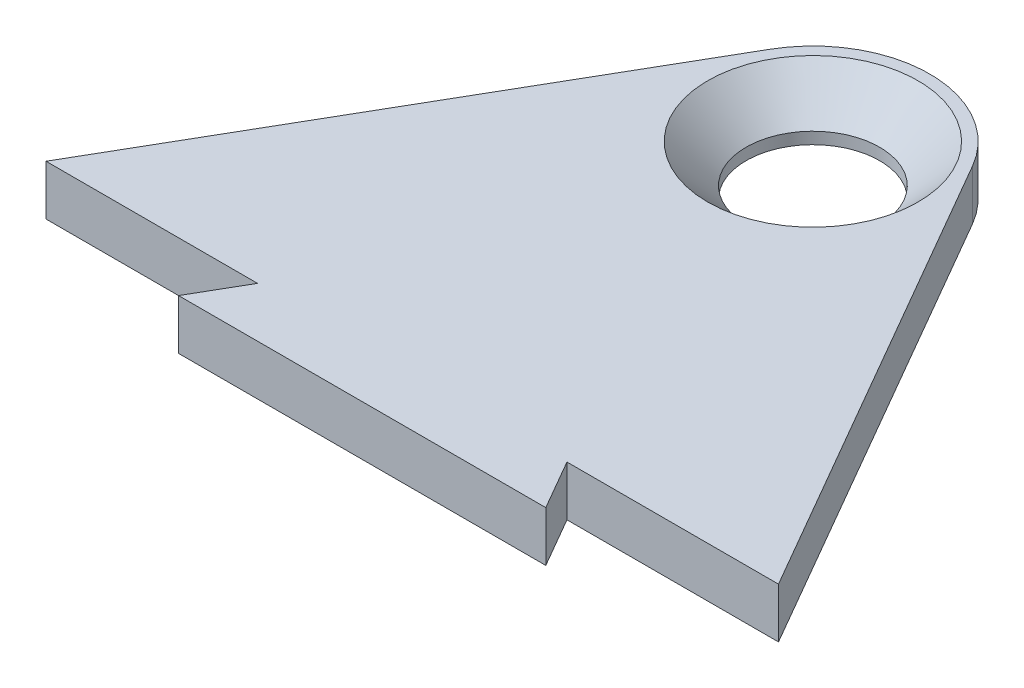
ISO-10303-21;
HEADER;
FILE_DESCRIPTION(('STEP AP214'),'2;1');
FILE_NAME('part.step','',(''),(''),'','','');
FILE_SCHEMA(('AUTOMOTIVE_DESIGN { 1 0 10303 214 1 1 1 1 }'));
ENDSEC;
DATA;
#1=APPLICATION_CONTEXT('core data for automotive mechanical design processes');
#2=APPLICATION_PROTOCOL_DEFINITION('international standard','automotive_design',2000,#1);
#3=PRODUCT_CONTEXT('',#1,'mechanical');
#4=PRODUCT('Part','Part','',(#3));
#5=PRODUCT_RELATED_PRODUCT_CATEGORY('part','',(#4));
#6=PRODUCT_DEFINITION_FORMATION('','',#4);
#7=PRODUCT_DEFINITION_CONTEXT('part definition',#1,'design');
#8=PRODUCT_DEFINITION('design','',#6,#7);
#9=PRODUCT_DEFINITION_SHAPE('','',#8);
#10=(LENGTH_UNIT() NAMED_UNIT(*) SI_UNIT(.MILLI.,.METRE.));
#11=(NAMED_UNIT(*) PLANE_ANGLE_UNIT() SI_UNIT($,.RADIAN.));
#12=(NAMED_UNIT(*) SI_UNIT($,.STERADIAN.) SOLID_ANGLE_UNIT());
#13=UNCERTAINTY_MEASURE_WITH_UNIT(LENGTH_MEASURE(1.E-05),#10,'distance_accuracy_value','');
#14=(GEOMETRIC_REPRESENTATION_CONTEXT(3) GLOBAL_UNCERTAINTY_ASSIGNED_CONTEXT((#13)) GLOBAL_UNIT_ASSIGNED_CONTEXT((#10,
#11,#12)) REPRESENTATION_CONTEXT('',''));
#15=CARTESIAN_POINT('',(0.,0.,0.));
#16=DIRECTION('',(0.,0.,1.));
#17=DIRECTION('',(1.,0.,0.));
#18=AXIS2_PLACEMENT_3D('',#15,#16,#17);
#19=CARTESIAN_POINT('',(0.,3.,-26.9999999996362));
#20=DIRECTION('',(0.,-1.,0.));
#21=DIRECTION('',(0.,0.,-1.));
#22=AXIS2_PLACEMENT_3D('',#19,#20,#21);
#23=CYLINDRICAL_SURFACE('',#22,6.99999999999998);
#24=CARTESIAN_POINT('',(0.,0.,-26.9999999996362));
#25=DIRECTION('',(0.,1.,0.));
#26=DIRECTION('',(0.,0.,1.));
#27=AXIS2_PLACEMENT_3D('',#24,#25,#26);
#28=CIRCLE('',#27,6.99999999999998);
#29=CARTESIAN_POINT('',(6.06217782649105,0.,-30.4999999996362));
#30=VERTEX_POINT('',#29);
#31=CARTESIAN_POINT('',(-6.06217782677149,0.,-30.4999999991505));
#32=VERTEX_POINT('',#31);
#33=EDGE_CURVE('E126',#30,#32,#28,.T.);
#34=ORIENTED_EDGE('',*,*,#33,.T.);
#35=DIRECTION('',(0.,-1.,0.));
#36=VECTOR('',#35,1.);
#37=CARTESIAN_POINT('',(-6.06217782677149,3.,-30.4999999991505));
#38=LINE('',#37,#36);
#39=CARTESIAN_POINT('',(-6.06217782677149,3.,-30.4999999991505));
#40=VERTEX_POINT('',#39);
#41=EDGE_CURVE('E11',#40,#32,#38,.T.);
#42=ORIENTED_EDGE('',*,*,#41,.F.);
#43=CARTESIAN_POINT('',(0.,3.,-26.9999999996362));
#44=DIRECTION('',(0.,1.,0.));
#45=DIRECTION('',(0.,0.,1.));
#46=AXIS2_PLACEMENT_3D('',#43,#44,#45);
#47=CIRCLE('',#46,6.99999999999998);
#48=CARTESIAN_POINT('',(6.06217782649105,3.,-30.4999999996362));
#49=VERTEX_POINT('',#48);
#50=EDGE_CURVE('E141',#49,#40,#47,.T.);
#51=ORIENTED_EDGE('',*,*,#50,.F.);
#52=DIRECTION('',(0.,-1.,0.));
#53=VECTOR('',#52,1.);
#54=CARTESIAN_POINT('',(6.06217782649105,3.,-30.4999999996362));
#55=LINE('',#54,#53);
#56=EDGE_CURVE('E122',#49,#30,#55,.T.);
#57=ORIENTED_EDGE('',*,*,#56,.T.);
#58=EDGE_LOOP('',(#34,#42,#51,#57));
#59=FACE_BOUND('',#58,.T.);
#60=ADVANCED_FACE('F30',(#59),#23,.T.);
#61=CARTESIAN_POINT('',(-21.9393102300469,3.,-2.9999999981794));
#62=DIRECTION('',(0.866025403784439,0.,0.5));
#63=DIRECTION('',(0.5,0.,-0.866025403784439));
#64=AXIS2_PLACEMENT_3D('',#61,#62,#63);
#65=PLANE('',#64);
#66=DIRECTION('',(-0.5,0.,0.866025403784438));
#67=VECTOR('',#66,1.);
#68=CARTESIAN_POINT('',(-21.9393102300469,0.,-2.9999999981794));
#69=LINE('',#68,#67);
#70=CARTESIAN_POINT('',(-21.9393102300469,0.,-2.9999999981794));
#71=VERTEX_POINT('',#70);
#72=EDGE_CURVE('E129',#32,#71,#69,.T.);
#73=ORIENTED_EDGE('',*,*,#72,.T.);
#74=DIRECTION('',(0.,-1.,0.));
#75=VECTOR('',#74,1.);
#76=CARTESIAN_POINT('',(-21.9393102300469,3.,-2.9999999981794));
#77=LINE('',#76,#75);
#78=CARTESIAN_POINT('',(-21.9393102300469,3.,-2.9999999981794));
#79=VERTEX_POINT('',#78);
#80=EDGE_CURVE('E38',#79,#71,#77,.T.);
#81=ORIENTED_EDGE('',*,*,#80,.F.);
#82=DIRECTION('',(-0.5,0.,0.866025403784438));
#83=VECTOR('',#82,1.);
#84=CARTESIAN_POINT('',(-21.9393102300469,3.,-2.9999999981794));
#85=LINE('',#84,#83);
#86=EDGE_CURVE('E89',#40,#79,#85,.T.);
#87=ORIENTED_EDGE('',*,*,#86,.F.);
#88=ORIENTED_EDGE('',*,*,#41,.T.);
#89=EDGE_LOOP('',(#73,#81,#87,#88));
#90=FACE_BOUND('',#89,.T.);
#91=ADVANCED_FACE('F198',(#90),#65,.F.);
#92=CARTESIAN_POINT('',(-21.9393102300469,3.,-2.9999999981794));
#93=DIRECTION('',(0.,0.,-1.));
#94=DIRECTION('',(-1.,0.,0.));
#95=AXIS2_PLACEMENT_3D('',#92,#93,#94);
#96=PLANE('',#95);
#97=DIRECTION('',(1.,0.,0.));
#98=VECTOR('',#97,1.);
#99=CARTESIAN_POINT('',(-21.9393102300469,0.,-2.9999999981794));
#100=LINE('',#99,#98);
#101=CARTESIAN_POINT('',(-9.26794919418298,0.,-2.9999999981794));
#102=VERTEX_POINT('',#101);
#103=EDGE_CURVE('E132',#71,#102,#100,.T.);
#104=ORIENTED_EDGE('',*,*,#103,.T.);
#105=DIRECTION('',(0.,-1.,0.));
#106=VECTOR('',#105,1.);
#107=CARTESIAN_POINT('',(-9.26794919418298,3.,-2.9999999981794));
#108=LINE('',#107,#106);
#109=CARTESIAN_POINT('',(-9.26794919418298,3.,-2.9999999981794));
#110=VERTEX_POINT('',#109);
#111=EDGE_CURVE('E148',#110,#102,#108,.T.);
#112=ORIENTED_EDGE('',*,*,#111,.F.);
#113=DIRECTION('',(1.,0.,0.));
#114=VECTOR('',#113,1.);
#115=CARTESIAN_POINT('',(-21.9393102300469,3.,-2.9999999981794));
#116=LINE('',#115,#114);
#117=EDGE_CURVE('E156',#79,#110,#116,.T.);
#118=ORIENTED_EDGE('',*,*,#117,.F.);
#119=ORIENTED_EDGE('',*,*,#80,.T.);
#120=EDGE_LOOP('',(#104,#112,#118,#119));
#121=FACE_BOUND('',#120,.T.);
#122=ADVANCED_FACE('F154',(#121),#96,.F.);
#123=CARTESIAN_POINT('',(-11.0000000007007,3.,0.));
#124=DIRECTION('',(0.866025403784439,0.,0.499999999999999));
#125=DIRECTION('',(0.499999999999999,0.,-0.866025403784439));
#126=AXIS2_PLACEMENT_3D('',#123,#124,#125);
#127=PLANE('',#126);
#128=DIRECTION('',(-0.499999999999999,0.,0.866025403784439));
#129=VECTOR('',#128,1.);
#130=CARTESIAN_POINT('',(-11.0000000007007,0.,0.));
#131=LINE('',#130,#129);
#132=CARTESIAN_POINT('',(-11.0000000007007,0.,0.));
#133=VERTEX_POINT('',#132);
#134=EDGE_CURVE('E134',#102,#133,#131,.T.);
#135=ORIENTED_EDGE('',*,*,#134,.T.);
#136=DIRECTION('',(0.,-1.,0.));
#137=VECTOR('',#136,1.);
#138=CARTESIAN_POINT('',(-11.0000000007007,3.,0.));
#139=LINE('',#138,#137);
#140=CARTESIAN_POINT('',(-11.0000000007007,3.,0.));
#141=VERTEX_POINT('',#140);
#142=EDGE_CURVE('E145',#141,#133,#139,.T.);
#143=ORIENTED_EDGE('',*,*,#142,.F.);
#144=DIRECTION('',(-0.499999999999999,0.,0.866025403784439));
#145=VECTOR('',#144,1.);
#146=CARTESIAN_POINT('',(-11.0000000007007,3.,0.));
#147=LINE('',#146,#145);
#148=EDGE_CURVE('E168',#110,#141,#147,.T.);
#149=ORIENTED_EDGE('',*,*,#148,.F.);
#150=ORIENTED_EDGE('',*,*,#111,.T.);
#151=EDGE_LOOP('',(#135,#143,#149,#150));
#152=FACE_BOUND('',#151,.T.);
#153=ADVANCED_FACE('F164',(#152),#127,.F.);
#154=CARTESIAN_POINT('',(-11.0000000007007,3.,0.));
#155=DIRECTION('',(0.,0.,-1.));
#156=DIRECTION('',(-1.,0.,0.));
#157=AXIS2_PLACEMENT_3D('',#154,#155,#156);
#158=PLANE('',#157);
#159=DIRECTION('',(1.,0.,0.));
#160=VECTOR('',#159,1.);
#161=CARTESIAN_POINT('',(-11.0000000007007,0.,0.));
#162=LINE('',#161,#160);
#163=CARTESIAN_POINT('',(10.9999999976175,0.,0.));
#164=VERTEX_POINT('',#163);
#165=EDGE_CURVE('E136',#133,#164,#162,.T.);
#166=ORIENTED_EDGE('',*,*,#165,.T.);
#167=DIRECTION('',(0.,-1.,0.));
#168=VECTOR('',#167,1.);
#169=CARTESIAN_POINT('',(10.9999999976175,3.,0.));
#170=LINE('',#169,#168);
#171=CARTESIAN_POINT('',(10.9999999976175,3.,0.));
#172=VERTEX_POINT('',#171);
#173=EDGE_CURVE('E117',#172,#164,#170,.T.);
#174=ORIENTED_EDGE('',*,*,#173,.F.);
#175=DIRECTION('',(1.,0.,0.));
#176=VECTOR('',#175,1.);
#177=CARTESIAN_POINT('',(-11.0000000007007,3.,0.));
#178=LINE('',#177,#176);
#179=EDGE_CURVE('E108',#141,#172,#178,.T.);
#180=ORIENTED_EDGE('',*,*,#179,.F.);
#181=ORIENTED_EDGE('',*,*,#142,.T.);
#182=EDGE_LOOP('',(#166,#174,#180,#181));
#183=FACE_BOUND('',#182,.T.);
#184=ADVANCED_FACE('F167',(#183),#158,.F.);
#185=CARTESIAN_POINT('',(10.9999999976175,3.,0.));
#186=DIRECTION('',(-0.866025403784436,0.,0.500000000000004));
#187=DIRECTION('',(0.500000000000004,0.,0.866025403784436));
#188=AXIS2_PLACEMENT_3D('',#185,#186,#187);
#189=PLANE('',#188);
#190=DIRECTION('',(-0.500000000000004,0.,-0.866025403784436));
#191=VECTOR('',#190,1.);
#192=CARTESIAN_POINT('',(10.9999999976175,0.,0.));
#193=LINE('',#192,#191);
#194=CARTESIAN_POINT('',(9.26794919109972,0.,-2.9999999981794));
#195=VERTEX_POINT('',#194);
#196=EDGE_CURVE('E116',#164,#195,#193,.T.);
#197=ORIENTED_EDGE('',*,*,#196,.T.);
#198=DIRECTION('',(0.,-1.,0.));
#199=VECTOR('',#198,1.);
#200=CARTESIAN_POINT('',(9.26794919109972,3.,-2.9999999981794));
#201=LINE('',#200,#199);
#202=CARTESIAN_POINT('',(9.26794919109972,3.,-2.9999999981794));
#203=VERTEX_POINT('',#202);
#204=EDGE_CURVE('E113',#203,#195,#201,.T.);
#205=ORIENTED_EDGE('',*,*,#204,.F.);
#206=DIRECTION('',(-0.500000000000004,0.,-0.866025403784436));
#207=VECTOR('',#206,1.);
#208=CARTESIAN_POINT('',(10.9999999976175,3.,0.));
#209=LINE('',#208,#207);
#210=EDGE_CURVE('E102',#172,#203,#209,.T.);
#211=ORIENTED_EDGE('',*,*,#210,.F.);
#212=ORIENTED_EDGE('',*,*,#173,.T.);
#213=EDGE_LOOP('',(#197,#205,#211,#212));
#214=FACE_BOUND('',#213,.T.);
#215=ADVANCED_FACE('F114',(#214),#189,.F.);
#216=CARTESIAN_POINT('',(9.26794919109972,3.,-2.9999999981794));
#217=DIRECTION('',(0.,0.,-1.));
#218=DIRECTION('',(-1.,0.,0.));
#219=AXIS2_PLACEMENT_3D('',#216,#217,#218);
#220=PLANE('',#219);
#221=DIRECTION('',(1.,0.,0.));
#222=VECTOR('',#221,1.);
#223=CARTESIAN_POINT('',(9.26794919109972,0.,-2.9999999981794));
#224=LINE('',#223,#222);
#225=CARTESIAN_POINT('',(21.9393102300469,0.,-2.9999999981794));
#226=VERTEX_POINT('',#225);
#227=EDGE_CURVE('E75',#195,#226,#224,.T.);
#228=ORIENTED_EDGE('',*,*,#227,.T.);
#229=DIRECTION('',(0.,-1.,0.));
#230=VECTOR('',#229,1.);
#231=CARTESIAN_POINT('',(21.9393102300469,3.,-2.9999999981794));
#232=LINE('',#231,#230);
#233=CARTESIAN_POINT('',(21.9393102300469,3.,-2.9999999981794));
#234=VERTEX_POINT('',#233);
#235=EDGE_CURVE('E118',#234,#226,#232,.T.);
#236=ORIENTED_EDGE('',*,*,#235,.F.);
#237=DIRECTION('',(1.,0.,0.));
#238=VECTOR('',#237,1.);
#239=CARTESIAN_POINT('',(9.26794919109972,3.,-2.9999999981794));
#240=LINE('',#239,#238);
#241=EDGE_CURVE('E106',#203,#234,#240,.T.);
#242=ORIENTED_EDGE('',*,*,#241,.F.);
#243=ORIENTED_EDGE('',*,*,#204,.T.);
#244=EDGE_LOOP('',(#228,#236,#242,#243));
#245=FACE_BOUND('',#244,.T.);
#246=ADVANCED_FACE('F120',(#245),#220,.F.);
#247=CARTESIAN_POINT('',(21.9393102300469,3.,-2.9999999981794));
#248=DIRECTION('',(-0.866025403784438,0.,0.500000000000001));
#249=DIRECTION('',(0.500000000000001,0.,0.866025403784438));
#250=AXIS2_PLACEMENT_3D('',#247,#248,#249);
#251=PLANE('',#250);
#252=DIRECTION('',(-0.500000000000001,0.,-0.866025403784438));
#253=VECTOR('',#252,1.);
#254=CARTESIAN_POINT('',(21.9393102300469,0.,-2.9999999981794));
#255=LINE('',#254,#253);
#256=EDGE_CURVE('E81',#226,#30,#255,.T.);
#257=ORIENTED_EDGE('',*,*,#256,.T.);
#258=ORIENTED_EDGE('',*,*,#56,.F.);
#259=DIRECTION('',(-0.500000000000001,0.,-0.866025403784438));
#260=VECTOR('',#259,1.);
#261=CARTESIAN_POINT('',(21.9393102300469,3.,-2.9999999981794));
#262=LINE('',#261,#260);
#263=EDGE_CURVE('E46',#234,#49,#262,.T.);
#264=ORIENTED_EDGE('',*,*,#263,.F.);
#265=ORIENTED_EDGE('',*,*,#235,.T.);
#266=EDGE_LOOP('',(#257,#258,#264,#265));
#267=FACE_BOUND('',#266,.T.);
#268=ADVANCED_FACE('F186',(#267),#251,.F.);
#269=CARTESIAN_POINT('',(0.,3.,-26.9999999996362));
#270=DIRECTION('',(0.,1.,0.));
#271=DIRECTION('',(0.,0.,1.));
#272=AXIS2_PLACEMENT_3D('',#269,#270,#271);
#273=PLANE('',#272);
#274=CARTESIAN_POINT('',(0.,3.,-27.));
#275=DIRECTION('',(0.,1.,0.));
#276=DIRECTION('',(0.,0.,1.));
#277=AXIS2_PLACEMENT_3D('',#274,#275,#276);
#278=CIRCLE('',#277,6.3);
#279=CARTESIAN_POINT('',(0.,3.,-20.7));
#280=VERTEX_POINT('',#279);
#281=EDGE_CURVE('E179',#280,#280,#278,.T.);
#282=ORIENTED_EDGE('',*,*,#281,.F.);
#283=EDGE_LOOP('',(#282));
#284=FACE_BOUND('',#283,.T.);
#285=ORIENTED_EDGE('',*,*,#50,.T.);
#286=ORIENTED_EDGE('',*,*,#86,.T.);
#287=ORIENTED_EDGE('',*,*,#117,.T.);
#288=ORIENTED_EDGE('',*,*,#148,.T.);
#289=ORIENTED_EDGE('',*,*,#179,.T.);
#290=ORIENTED_EDGE('',*,*,#210,.T.);
#291=ORIENTED_EDGE('',*,*,#241,.T.);
#292=ORIENTED_EDGE('',*,*,#263,.T.);
#293=EDGE_LOOP('',(#285,#286,#287,#288,#289,#290,#291,#292));
#294=FACE_BOUND('',#293,.T.);
#295=ADVANCED_FACE('F104',(#284,#294),#273,.T.);
#296=CARTESIAN_POINT('',(0.,0.,-26.9999999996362));
#297=DIRECTION('',(0.,1.,0.));
#298=DIRECTION('',(0.,0.,1.));
#299=AXIS2_PLACEMENT_3D('',#296,#297,#298);
#300=PLANE('',#299);
#301=CARTESIAN_POINT('',(0.,0.,-27.));
#302=DIRECTION('',(0.,1.,0.));
#303=DIRECTION('',(0.,0.,1.));
#304=AXIS2_PLACEMENT_3D('',#301,#302,#303);
#305=CIRCLE('',#304,4.);
#306=CARTESIAN_POINT('',(0.,0.,-23.));
#307=VERTEX_POINT('',#306);
#308=EDGE_CURVE('E130',#307,#307,#305,.T.);
#309=ORIENTED_EDGE('',*,*,#308,.T.);
#310=EDGE_LOOP('',(#309));
#311=FACE_BOUND('',#310,.T.);
#312=ORIENTED_EDGE('',*,*,#33,.F.);
#313=ORIENTED_EDGE('',*,*,#256,.F.);
#314=ORIENTED_EDGE('',*,*,#227,.F.);
#315=ORIENTED_EDGE('',*,*,#196,.F.);
#316=ORIENTED_EDGE('',*,*,#165,.F.);
#317=ORIENTED_EDGE('',*,*,#134,.F.);
#318=ORIENTED_EDGE('',*,*,#103,.F.);
#319=ORIENTED_EDGE('',*,*,#72,.F.);
#320=EDGE_LOOP('',(#312,#313,#314,#315,#316,#317,#318,#319));
#321=FACE_BOUND('',#320,.T.);
#322=ADVANCED_FACE('F160',(#311,#321),#300,.F.);
#323=CARTESIAN_POINT('',(0.,3.,-27.));
#324=DIRECTION('',(0.,1.,0.));
#325=DIRECTION('',(0.,0.,1.));
#326=AXIS2_PLACEMENT_3D('',#323,#324,#325);
#327=CYLINDRICAL_SURFACE('',#326,4.);
#328=ORIENTED_EDGE('',*,*,#308,.F.);
#329=EDGE_LOOP('',(#328));
#330=FACE_BOUND('',#329,.T.);
#331=CARTESIAN_POINT('',(0.,0.699999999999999,-27.));
#332=DIRECTION('',(0.,1.,0.));
#333=DIRECTION('',(0.,0.,1.));
#334=AXIS2_PLACEMENT_3D('',#331,#332,#333);
#335=CIRCLE('',#334,4.);
#336=CARTESIAN_POINT('',(0.,0.699999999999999,-23.));
#337=VERTEX_POINT('',#336);
#338=EDGE_CURVE('E176',#337,#337,#335,.T.);
#339=ORIENTED_EDGE('',*,*,#338,.T.);
#340=EDGE_LOOP('',(#339));
#341=FACE_BOUND('',#340,.T.);
#342=ADVANCED_FACE('F192',(#330,#341),#327,.F.);
#343=CARTESIAN_POINT('',(0.,3.,-27.));
#344=DIRECTION('',(0.,1.,0.));
#345=DIRECTION('',(0.,0.,1.));
#346=AXIS2_PLACEMENT_3D('',#343,#344,#345);
#347=CONICAL_SURFACE('',#346,6.3,0.785398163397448);
#348=ORIENTED_EDGE('',*,*,#338,.F.);
#349=EDGE_LOOP('',(#348));
#350=FACE_BOUND('',#349,.T.);
#351=ORIENTED_EDGE('',*,*,#281,.T.);
#352=EDGE_LOOP('',(#351));
#353=FACE_BOUND('',#352,.T.);
#354=ADVANCED_FACE('F183',(#350,#353),#347,.F.);
#355=CLOSED_SHELL('',(#60,#91,#122,#153,#184,#215,#246,#268,#295,#322,#342,#354));
#356=MANIFOLD_SOLID_BREP('B2',#355);
#357=ADVANCED_BREP_SHAPE_REPRESENTATION('',(#18,#356),#14);
#358=SHAPE_DEFINITION_REPRESENTATION(#9,#357);
ENDSEC;
END-ISO-10303-21;
